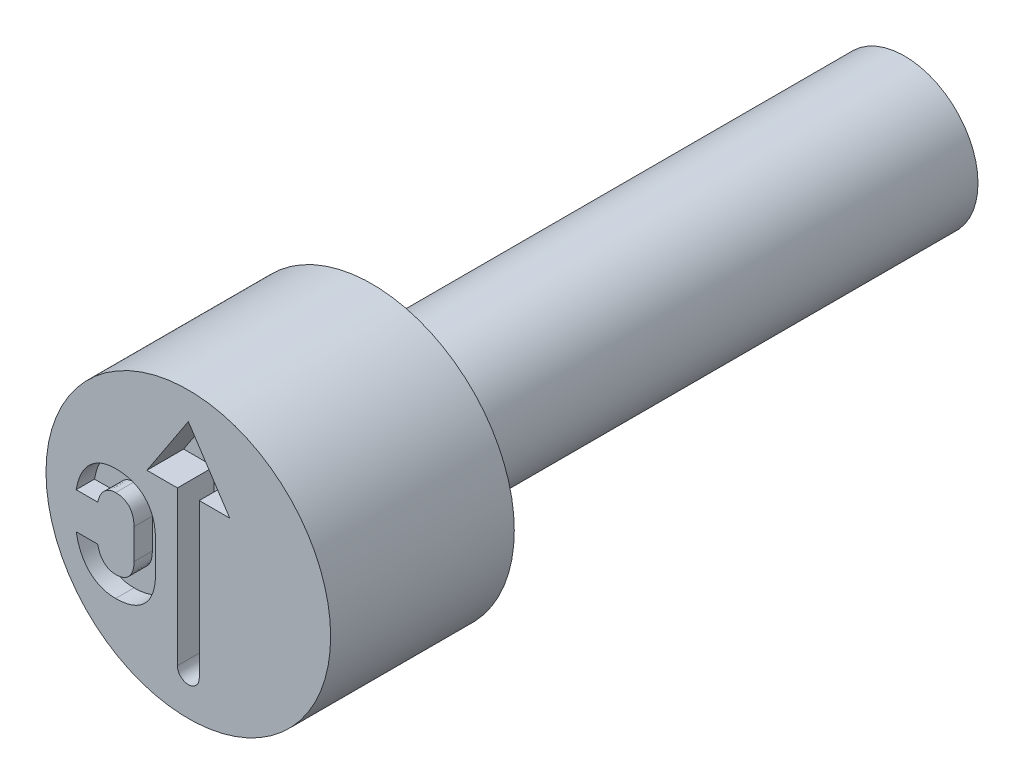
from build123d import *

# Parameters (mm, degrees)
CUT_EXTRUDE4_DEPTH = 0.4
CUT_EXTRUDE5_DEPTH = 0.2


with BuildPart() as part:
    # Sketch2 → Revolve1 (revolve)
    with BuildSketch(Plane(origin=(0, 0, 0), x_dir=(0, 0, -1), z_dir=(1, 0, 0)), mode=Mode.PRIVATE) as revolve1_sk:
        Polygon((0, 1.55), (0, 0), (7.8, 0), (7.8, 0.8), (2, 0.8), (2, 1.55), align=None)
    revolve(revolve1_sk.sketch.rotate(Axis((0, 0, -0.403888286), (0, 0, -1)), 90), axis=Axis((0, 0, -0.403888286), (0, 0, -1)))

    # Sketch3 → Cut-Extrude4 (cut)
    with BuildSketch(Plane.XY):
        with BuildLine():
            Line((0.119045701, 0.566469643), (0.119045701, -1.110101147))
            ThreePointArc((0.119045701, -1.110101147), (0, -1.229146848), (-0.119045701, -1.110101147))
            Line((-0.119045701, -1.110101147), (-0.119045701, 0.566469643))
            Line((-0.119045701, 0.566469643), (-0.451198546, 0.566469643))
            Line((-0.451198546, 0.566469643), (0, 1.251322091))
            Line((0, 1.251322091), (0.451198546, 0.566469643))
            Line((0.451198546, 0.566469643), (0.119045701, 0.566469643))
        make_face()
    extrude(amount=-CUT_EXTRUDE4_DEPTH, mode=Mode.SUBTRACT)

    # Sketch4 → Cut-Extrude5 (cut)
    with BuildSketch(Plane.XY):
        with BuildLine():
            add(Edge.make_bspline(
                [(-0.791430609, -0.812471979), (-0.780258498, -0.812351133), (-0.75821246, -0.812112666), (-0.725795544, -0.809631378), (-0.694521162, -0.805483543), (-0.664559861, -0.799634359), (-0.635828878, -0.792255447), (-0.608205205, -0.783533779), (-0.581954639, -0.772736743), (-0.556822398, -0.760492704), (-0.533162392, -0.746634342), (-0.511024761, -0.731046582), (-0.490189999, -0.714218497), (-0.470816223, -0.695812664), (-0.452923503, -0.675936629), (-0.436410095, -0.654568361), (-0.421615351, -0.631571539), (-0.408081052, -0.607256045), (-0.396039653, -0.581555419), (-0.38587658, -0.554346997), (-0.377065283, -0.525931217), (-0.369694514, -0.496312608), (-0.364051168, -0.465356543), (-0.36028953, -0.433086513), (-0.357681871, -0.39947215), (-0.357466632, -0.376610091), (-0.357356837, -0.364948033)],
                knots=[0, 0, 0, 0, 1.134237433, 2.238201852, 3.298772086, 4.336057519, 5.335809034, 6.309558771, 7.274828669, 8.21507465, 9.146315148, 10.055631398, 10.961815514, 11.863452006, 12.765999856, 13.674901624, 14.60241943, 15.539819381, 16.498894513, 17.481225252, 18.486546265, 19.518401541, 20.578551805, 21.679128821, 22.816111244, 24, 24, 24, 24], degree=3))
            Line((-0.357356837, -0.364948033), (-0.357356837, -0.035785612))
            add(Edge.make_bspline(
                [(-0.357356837, -0.035785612), (-0.357466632, -0.024123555), (-0.357681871, -0.001261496), (-0.360289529, 0.032352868), (-0.36405117, 0.064622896), (-0.369694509, 0.095578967), (-0.377065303, 0.125197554), (-0.385876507, 0.153613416), (-0.396039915, 0.180821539), (-0.408080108, 0.206523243), (-0.421618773, 0.230834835), (-0.436397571, 0.253845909), (-0.453006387, 0.275210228), (-0.470729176, 0.295319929), (-0.490200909, 0.313720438), (-0.511024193, 0.330554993), (-0.533153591, 0.346164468), (-0.556890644, 0.359945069), (-0.581878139, 0.372572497), (-0.608264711, 0.383198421), (-0.635774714, 0.392337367), (-0.664568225, 0.39960951), (-0.694518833, 0.405490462), (-0.725796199, 0.409629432), (-0.758212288, 0.412113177), (-0.78025844, 0.412351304), (-0.791430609, 0.412471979)],
                knots=[0, 0, 0, 0, 1.183277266, 2.319672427, 3.419680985, 4.479283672, 5.510605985, 6.515407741, 7.497231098, 8.455810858, 9.392726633, 10.319765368, 11.22819768, 12.136441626, 13.037612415, 13.943328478, 14.852175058, 15.782934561, 16.726365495, 17.691136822, 18.666946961, 19.666182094, 20.70293176, 21.7629542, 22.866348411, 24, 24, 24, 24], degree=3))
            add(Edge.make_bspline(
                [(-0.791430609, 0.412471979), (-0.80981555, 0.411979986), (-0.845854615, 0.411015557), (-0.898234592, 0.40133204), (-0.947698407, 0.386255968), (-0.993956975, 0.364758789), (-1.036865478, 0.337635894), (-1.075921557, 0.304635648), (-1.111112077, 0.266190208), (-1.142133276, 0.222142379), (-1.169073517, 0.173106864), (-1.191251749, 0.119077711), (-1.209253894, 0.060457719), (-1.217243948, 0.019327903), (-1.221347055, -0.001793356)],
                knots=[0, 0, 0, 0, 1.00806925, 1.976066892, 2.912865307, 3.839664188, 4.766819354, 5.690806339, 6.637604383, 7.619531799, 8.640729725, 9.701744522, 10.819784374, 12, 12, 12, 12], degree=3))
            Line((-1.221347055, -0.001793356), (-0.987069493, -0.001793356))
            add(Edge.make_bspline(
                [(-0.987069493, -0.001793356), (-0.984706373, 0.007792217), (-0.980107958, 0.026444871), (-0.970640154, 0.052979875), (-0.959874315, 0.077558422), (-0.946707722, 0.099594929), (-0.932374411, 0.119621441), (-0.916209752, 0.13697175), (-0.898567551, 0.151933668), (-0.879584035, 0.164308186), (-0.859310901, 0.174393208), (-0.83765588, 0.181067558), (-0.814917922, 0.185425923), (-0.799358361, 0.185981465), (-0.791430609, 0.18626452)],
                knots=[0, 0, 0, 0, 1.203096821, 2.341117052, 3.431111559, 4.469295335, 5.465369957, 6.42892467, 7.35290722, 8.279239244, 9.186115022, 10.104036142, 11.033987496, 12, 12, 12, 12], degree=3))
            add(Edge.make_bspline(
                [(-0.791430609, 0.18626452), (-0.781226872, 0.185907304), (-0.76152332, 0.185217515), (-0.73297918, 0.180723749), (-0.706978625, 0.172258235), (-0.683158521, 0.161027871), (-0.661879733, 0.146482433), (-0.643370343, 0.128650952), (-0.627621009, 0.107775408), (-0.614349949, 0.084215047), (-0.604088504, 0.057770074), (-0.596868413, 0.028766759), (-0.592400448, -0.00271483), (-0.591895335, -0.024520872), (-0.5916344, -0.035785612)],
                knots=[0, 0, 0, 0, 1.082677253, 2.090664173, 3.053339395, 3.973921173, 4.875832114, 5.774919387, 6.688160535, 7.640683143, 8.634736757, 9.687648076, 10.805466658, 12, 12, 12, 12], degree=3))
            Line((-0.5916344, -0.035785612), (-0.5916344, -0.364948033))
            add(Edge.make_bspline(
                [(-0.5916344, -0.364948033), (-0.591898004, -0.37621205), (-0.592408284, -0.398016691), (-0.596829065, -0.429429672), (-0.604142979, -0.458324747), (-0.614290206, -0.48465266), (-0.627619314, -0.50803769), (-0.643448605, -0.528668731), (-0.661869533, -0.546495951), (-0.683168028, -0.561000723), (-0.706927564, -0.572346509), (-0.733057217, -0.580321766), (-0.761487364, -0.585328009), (-0.781219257, -0.585945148), (-0.791430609, -0.58626452)],
                knots=[0, 0, 0, 0, 1.196920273, 2.316972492, 3.363591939, 4.359631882, 5.306515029, 6.214703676, 7.115587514, 8.019300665, 8.94172196, 9.903709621, 10.915159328, 12, 12, 12, 12], degree=3))
            add(Edge.make_bspline(
                [(-0.791430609, -0.58626452), (-0.799513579, -0.585946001), (-0.815367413, -0.585321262), (-0.838528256, -0.581496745), (-0.860334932, -0.574448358), (-0.880934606, -0.564951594), (-0.90017628, -0.552681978), (-0.917511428, -0.537522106), (-0.933658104, -0.520265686), (-0.948029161, -0.500350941), (-0.960768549, -0.478065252), (-0.971422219, -0.453400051), (-0.980669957, -0.426630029), (-0.984892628, -0.407713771), (-0.987069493, -0.397962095)],
                knots=[0, 0, 0, 0, 0.981077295, 1.924272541, 2.837745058, 3.753838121, 4.670304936, 5.59622504, 6.54113043, 7.532377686, 8.569122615, 9.649813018, 10.788435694, 12, 12, 12, 12], degree=3))
            Line((-0.987069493, -0.397962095), (-1.221347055, -0.397962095))
            add(Edge.make_bspline(
                [(-1.221347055, -0.397962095), (-1.217167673, -0.419166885), (-1.209042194, -0.460392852), (-1.190782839, -0.519101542), (-1.168281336, -0.573041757), (-1.141503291, -0.622132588), (-1.110285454, -0.66588861), (-1.075374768, -0.704473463), (-1.036476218, -0.737561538), (-0.993669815, -0.764820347), (-0.947448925, -0.786249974), (-0.898066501, -0.801299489), (-0.845777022, -0.811035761), (-0.809816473, -0.811986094), (-0.791430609, -0.812471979)],
                knots=[0, 0, 0, 0, 1.185884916, 2.305575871, 3.368634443, 4.390138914, 5.368714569, 6.312778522, 7.23993122, 8.163588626, 9.090665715, 10.027745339, 10.991628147, 12, 12, 12, 12], degree=3))
        make_face()
    extrude(amount=-CUT_EXTRUDE5_DEPTH, mode=Mode.SUBTRACT)


solid = part.part
